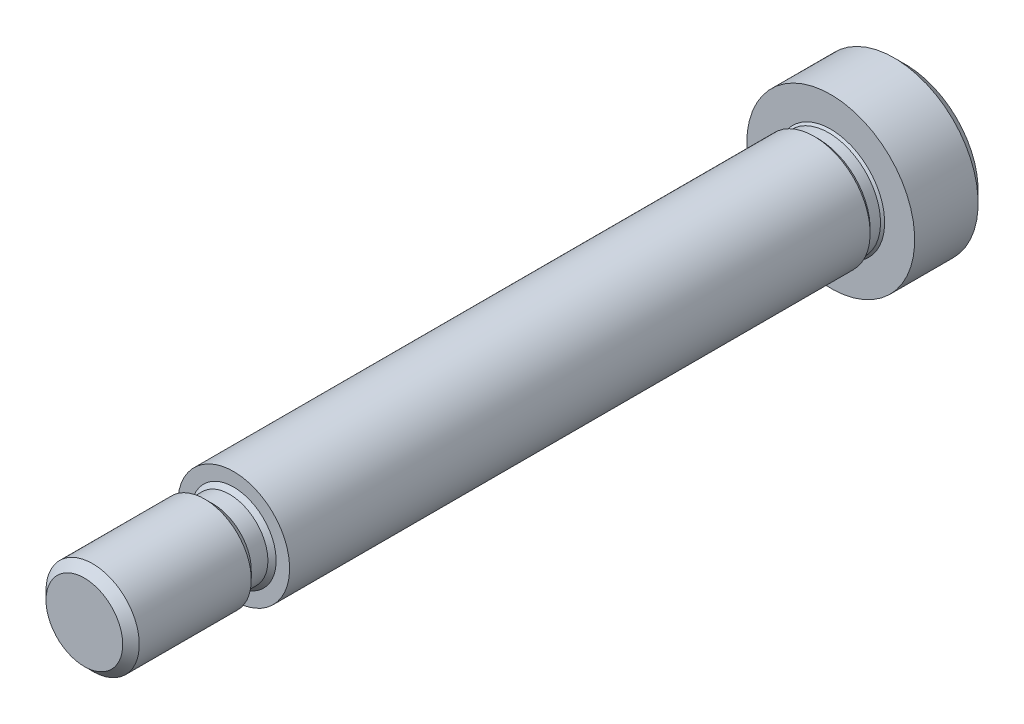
ISO-10303-21;
HEADER;
FILE_DESCRIPTION(('STEP AP214'),'2;1');
FILE_NAME('part.step','',(''),(''),'','','');
FILE_SCHEMA(('AUTOMOTIVE_DESIGN { 1 0 10303 214 1 1 1 1 }'));
ENDSEC;
DATA;
#1=APPLICATION_CONTEXT('core data for automotive mechanical design processes');
#2=APPLICATION_PROTOCOL_DEFINITION('international standard','automotive_design',2000,#1);
#3=PRODUCT_CONTEXT('',#1,'mechanical');
#4=PRODUCT('Part','Part','',(#3));
#5=PRODUCT_RELATED_PRODUCT_CATEGORY('part','',(#4));
#6=PRODUCT_DEFINITION_FORMATION('','',#4);
#7=PRODUCT_DEFINITION_CONTEXT('part definition',#1,'design');
#8=PRODUCT_DEFINITION('design','',#6,#7);
#9=PRODUCT_DEFINITION_SHAPE('','',#8);
#10=(LENGTH_UNIT() NAMED_UNIT(*) SI_UNIT(.MILLI.,.METRE.));
#11=(NAMED_UNIT(*) PLANE_ANGLE_UNIT() SI_UNIT($,.RADIAN.));
#12=(NAMED_UNIT(*) SI_UNIT($,.STERADIAN.) SOLID_ANGLE_UNIT());
#13=UNCERTAINTY_MEASURE_WITH_UNIT(LENGTH_MEASURE(1.E-05),#10,'distance_accuracy_value','');
#14=(GEOMETRIC_REPRESENTATION_CONTEXT(3) GLOBAL_UNCERTAINTY_ASSIGNED_CONTEXT((#13)) GLOBAL_UNIT_ASSIGNED_CONTEXT((#10,
#11,#12)) REPRESENTATION_CONTEXT('',''));
#15=CARTESIAN_POINT('',(0.,0.,0.));
#16=DIRECTION('',(0.,0.,1.));
#17=DIRECTION('',(1.,0.,0.));
#18=AXIS2_PLACEMENT_3D('',#15,#16,#17);
#19=CARTESIAN_POINT('',(0.,0.,-62.352722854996));
#20=DIRECTION('',(0.,0.,-1.));
#21=DIRECTION('',(-1.,0.,0.));
#22=AXIS2_PLACEMENT_3D('',#19,#20,#21);
#23=CYLINDRICAL_SURFACE('',#22,4.7625);
#24=CARTESIAN_POINT('',(0.,0.,-49.3903));
#25=DIRECTION('',(0.,0.,-1.));
#26=DIRECTION('',(-1.,0.,0.));
#27=AXIS2_PLACEMENT_3D('',#24,#25,#26);
#28=CIRCLE('',#27,4.76250000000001);
#29=CARTESIAN_POINT('',(-4.76250000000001,0.,-49.3903));
#30=VERTEX_POINT('',#29);
#31=EDGE_CURVE('E164',#30,#30,#28,.T.);
#32=ORIENTED_EDGE('',*,*,#31,.F.);
#33=EDGE_LOOP('',(#32));
#34=FACE_BOUND('',#33,.T.);
#35=CARTESIAN_POINT('',(0.,0.,0.));
#36=DIRECTION('',(0.,0.,-1.));
#37=DIRECTION('',(-1.,0.,0.));
#38=AXIS2_PLACEMENT_3D('',#35,#36,#37);
#39=CIRCLE('',#38,4.7625);
#40=CARTESIAN_POINT('',(-4.76250000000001,0.,0.));
#41=VERTEX_POINT('',#40);
#42=EDGE_CURVE('E11',#41,#41,#39,.T.);
#43=ORIENTED_EDGE('',*,*,#42,.T.);
#44=EDGE_LOOP('',(#43));
#45=FACE_BOUND('',#44,.T.);
#46=ADVANCED_FACE('F49',(#34,#45),#23,.T.);
#47=CARTESIAN_POINT('',(-4.76250000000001,0.,0.));
#48=DIRECTION('',(0.,0.,-1.));
#49=DIRECTION('',(-1.,0.,0.));
#50=AXIS2_PLACEMENT_3D('',#47,#48,#49);
#51=PLANE('',#50);
#52=ORIENTED_EDGE('',*,*,#42,.F.);
#53=EDGE_LOOP('',(#52));
#54=FACE_BOUND('',#53,.T.);
#55=CARTESIAN_POINT('',(0.,0.,0.));
#56=DIRECTION('',(0.,0.,-1.));
#57=DIRECTION('',(-1.,0.,0.));
#58=AXIS2_PLACEMENT_3D('',#55,#56,#57);
#59=CIRCLE('',#58,3.616325);
#60=CARTESIAN_POINT('',(-3.61632500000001,0.,0.));
#61=VERTEX_POINT('',#60);
#62=EDGE_CURVE('E57',#61,#61,#59,.T.);
#63=ORIENTED_EDGE('',*,*,#62,.T.);
#64=EDGE_LOOP('',(#63));
#65=FACE_BOUND('',#64,.T.);
#66=ADVANCED_FACE('F225',(#54,#65),#51,.F.);
#67=CARTESIAN_POINT('',(0.,0.,0.352425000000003));
#68=DIRECTION('',(0.,0.,-1.));
#69=DIRECTION('',(-1.,0.,0.));
#70=AXIS2_PLACEMENT_3D('',#67,#68,#69);
#71=CONICAL_SURFACE('',#70,3.2639,0.785398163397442);
#72=ORIENTED_EDGE('',*,*,#62,.F.);
#73=EDGE_LOOP('',(#72));
#74=FACE_BOUND('',#73,.T.);
#75=CARTESIAN_POINT('',(0.,0.,0.352425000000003));
#76=DIRECTION('',(0.,0.,-1.));
#77=DIRECTION('',(-1.,0.,0.));
#78=AXIS2_PLACEMENT_3D('',#75,#76,#77);
#79=CIRCLE('',#78,3.2639);
#80=CARTESIAN_POINT('',(-3.26390000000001,0.,0.352425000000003));
#81=VERTEX_POINT('',#80);
#82=EDGE_CURVE('E217',#81,#81,#79,.T.);
#83=ORIENTED_EDGE('',*,*,#82,.T.);
#84=EDGE_LOOP('',(#83));
#85=FACE_BOUND('',#84,.T.);
#86=ADVANCED_FACE('F227',(#74,#85),#71,.T.);
#87=CARTESIAN_POINT('',(0.,0.,-62.352722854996));
#88=DIRECTION('',(0.,0.,-1.));
#89=DIRECTION('',(-1.,0.,0.));
#90=AXIS2_PLACEMENT_3D('',#87,#88,#89);
#91=CYLINDRICAL_SURFACE('',#90,3.2639);
#92=ORIENTED_EDGE('',*,*,#82,.F.);
#93=EDGE_LOOP('',(#92));
#94=FACE_BOUND('',#93,.T.);
#95=CARTESIAN_POINT('',(0.,0.,1.762125));
#96=DIRECTION('',(0.,0.,-1.));
#97=DIRECTION('',(-1.,0.,0.));
#98=AXIS2_PLACEMENT_3D('',#95,#96,#97);
#99=CIRCLE('',#98,3.2639);
#100=CARTESIAN_POINT('',(-3.26390000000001,0.,1.762125));
#101=VERTEX_POINT('',#100);
#102=EDGE_CURVE('E213',#101,#101,#99,.T.);
#103=ORIENTED_EDGE('',*,*,#102,.T.);
#104=EDGE_LOOP('',(#103));
#105=FACE_BOUND('',#104,.T.);
#106=ADVANCED_FACE('F230',(#94,#105),#91,.T.);
#107=CARTESIAN_POINT('',(0.,0.,2.466975));
#108=DIRECTION('',(0.,0.,1.));
#109=DIRECTION('',(1.,0.,0.));
#110=AXIS2_PLACEMENT_3D('',#107,#108,#109);
#111=CONICAL_SURFACE('',#110,3.96875,0.785398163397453);
#112=ORIENTED_EDGE('',*,*,#102,.F.);
#113=EDGE_LOOP('',(#112));
#114=FACE_BOUND('',#113,.T.);
#115=CARTESIAN_POINT('',(0.,0.,2.466975));
#116=DIRECTION('',(0.,0.,-1.));
#117=DIRECTION('',(-1.,0.,0.));
#118=AXIS2_PLACEMENT_3D('',#115,#116,#117);
#119=CIRCLE('',#118,3.96875);
#120=CARTESIAN_POINT('',(-3.96875000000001,0.,2.466975));
#121=VERTEX_POINT('',#120);
#122=EDGE_CURVE('E209',#121,#121,#119,.T.);
#123=ORIENTED_EDGE('',*,*,#122,.T.);
#124=EDGE_LOOP('',(#123));
#125=FACE_BOUND('',#124,.T.);
#126=ADVANCED_FACE('F236',(#114,#125),#111,.T.);
#127=CARTESIAN_POINT('',(0.,0.,-62.352722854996));
#128=DIRECTION('',(0.,0.,-1.));
#129=DIRECTION('',(-1.,0.,0.));
#130=AXIS2_PLACEMENT_3D('',#127,#128,#129);
#131=CYLINDRICAL_SURFACE('',#130,3.96875);
#132=ORIENTED_EDGE('',*,*,#122,.F.);
#133=EDGE_LOOP('',(#132));
#134=FACE_BOUND('',#133,.T.);
#135=CARTESIAN_POINT('',(0.,0.,11.99515));
#136=DIRECTION('',(0.,0.,-1.));
#137=DIRECTION('',(-1.,0.,0.));
#138=AXIS2_PLACEMENT_3D('',#135,#136,#137);
#139=CIRCLE('',#138,3.96875);
#140=CARTESIAN_POINT('',(-3.96875000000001,0.,11.99515));
#141=VERTEX_POINT('',#140);
#142=EDGE_CURVE('E205',#141,#141,#139,.T.);
#143=ORIENTED_EDGE('',*,*,#142,.T.);
#144=EDGE_LOOP('',(#143));
#145=FACE_BOUND('',#144,.T.);
#146=ADVANCED_FACE('F242',(#134,#145),#131,.T.);
#147=CARTESIAN_POINT('',(0.,0.,12.7));
#148=DIRECTION('',(0.,0.,-1.));
#149=DIRECTION('',(-1.,0.,0.));
#150=AXIS2_PLACEMENT_3D('',#147,#148,#149);
#151=CONICAL_SURFACE('',#150,3.2639,0.785398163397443);
#152=ORIENTED_EDGE('',*,*,#142,.F.);
#153=EDGE_LOOP('',(#152));
#154=FACE_BOUND('',#153,.T.);
#155=CARTESIAN_POINT('',(0.,0.,12.7));
#156=DIRECTION('',(0.,0.,-1.));
#157=DIRECTION('',(-1.,0.,0.));
#158=AXIS2_PLACEMENT_3D('',#155,#156,#157);
#159=CIRCLE('',#158,3.2639);
#160=CARTESIAN_POINT('',(-3.26390000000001,0.,12.7));
#161=VERTEX_POINT('',#160);
#162=EDGE_CURVE('E201',#161,#161,#159,.T.);
#163=ORIENTED_EDGE('',*,*,#162,.T.);
#164=EDGE_LOOP('',(#163));
#165=FACE_BOUND('',#164,.T.);
#166=ADVANCED_FACE('F248',(#154,#165),#151,.T.);
#167=CARTESIAN_POINT('',(-3.26390000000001,0.,12.7));
#168=DIRECTION('',(0.,0.,-1.));
#169=DIRECTION('',(-1.,0.,0.));
#170=AXIS2_PLACEMENT_3D('',#167,#168,#169);
#171=PLANE('',#170);
#172=ORIENTED_EDGE('',*,*,#162,.F.);
#173=EDGE_LOOP('',(#172));
#174=FACE_BOUND('',#173,.T.);
#175=ADVANCED_FACE('F254',(#174),#171,.F.);
#176=CARTESIAN_POINT('',(-6.19125,0.,-57.15));
#177=DIRECTION('',(0.,0.,1.));
#178=DIRECTION('',(1.,0.,0.));
#179=AXIS2_PLACEMENT_3D('',#176,#177,#178);
#180=PLANE('',#179);
#181=DIRECTION('',(-0.5,-0.866025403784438,0.));
#182=VECTOR('',#181,1.);
#183=CARTESIAN_POINT('',(2.7496306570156,0.,-57.15));
#184=LINE('',#183,#182);
#185=CARTESIAN_POINT('',(2.7496306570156,0.,-57.15));
#186=VERTEX_POINT('',#185);
#187=CARTESIAN_POINT('',(1.3748153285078,-2.38125000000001,-57.15));
#188=VERTEX_POINT('',#187);
#189=EDGE_CURVE('E145',#186,#188,#184,.T.);
#190=ORIENTED_EDGE('',*,*,#189,.F.);
#191=DIRECTION('',(0.499999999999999,-0.866025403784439,0.));
#192=VECTOR('',#191,1.);
#193=CARTESIAN_POINT('',(1.3748153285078,2.38124999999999,-57.15));
#194=LINE('',#193,#192);
#195=CARTESIAN_POINT('',(1.3748153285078,2.38124999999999,-57.15));
#196=VERTEX_POINT('',#195);
#197=EDGE_CURVE('E64',#196,#186,#194,.T.);
#198=ORIENTED_EDGE('',*,*,#197,.F.);
#199=DIRECTION('',(1.,0.,0.));
#200=VECTOR('',#199,1.);
#201=CARTESIAN_POINT('',(-1.37481532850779,2.38124999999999,-57.15));
#202=LINE('',#201,#200);
#203=CARTESIAN_POINT('',(-1.37481532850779,2.38124999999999,-57.15));
#204=VERTEX_POINT('',#203);
#205=EDGE_CURVE('E158',#204,#196,#202,.T.);
#206=ORIENTED_EDGE('',*,*,#205,.F.);
#207=DIRECTION('',(0.5,0.866025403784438,0.));
#208=VECTOR('',#207,1.);
#209=CARTESIAN_POINT('',(-2.74963065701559,0.,-57.15));
#210=LINE('',#209,#208);
#211=CARTESIAN_POINT('',(-2.74963065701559,0.,-57.15));
#212=VERTEX_POINT('',#211);
#213=EDGE_CURVE('E155',#212,#204,#210,.T.);
#214=ORIENTED_EDGE('',*,*,#213,.F.);
#215=DIRECTION('',(-0.5,0.866025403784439,0.));
#216=VECTOR('',#215,1.);
#217=CARTESIAN_POINT('',(-1.37481532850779,-2.38125000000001,-57.15));
#218=LINE('',#217,#216);
#219=CARTESIAN_POINT('',(-1.37481532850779,-2.38125000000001,-57.15));
#220=VERTEX_POINT('',#219);
#221=EDGE_CURVE('E112',#220,#212,#218,.T.);
#222=ORIENTED_EDGE('',*,*,#221,.F.);
#223=DIRECTION('',(-1.,0.,0.));
#224=VECTOR('',#223,1.);
#225=CARTESIAN_POINT('',(1.3748153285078,-2.38125000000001,-57.15));
#226=LINE('',#225,#224);
#227=EDGE_CURVE('E149',#188,#220,#226,.T.);
#228=ORIENTED_EDGE('',*,*,#227,.F.);
#229=EDGE_LOOP('',(#190,#198,#206,#214,#222,#228));
#230=FACE_BOUND('',#229,.T.);
#231=CARTESIAN_POINT('',(0.,0.,-57.15));
#232=DIRECTION('',(0.,0.,-1.));
#233=DIRECTION('',(-1.,0.,0.));
#234=AXIS2_PLACEMENT_3D('',#231,#232,#233);
#235=CIRCLE('',#234,6.19125);
#236=CARTESIAN_POINT('',(-6.19125,0.,-57.15));
#237=VERTEX_POINT('',#236);
#238=EDGE_CURVE('E197',#237,#237,#235,.T.);
#239=ORIENTED_EDGE('',*,*,#238,.T.);
#240=EDGE_LOOP('',(#239));
#241=FACE_BOUND('',#240,.T.);
#242=ADVANCED_FACE('F259',(#230,#241),#180,.F.);
#243=CARTESIAN_POINT('',(0.,0.,-56.1975));
#244=DIRECTION('',(0.,0.,1.));
#245=DIRECTION('',(1.,0.,0.));
#246=AXIS2_PLACEMENT_3D('',#243,#244,#245);
#247=CONICAL_SURFACE('',#246,7.14375,0.78539816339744);
#248=ORIENTED_EDGE('',*,*,#238,.F.);
#249=EDGE_LOOP('',(#248));
#250=FACE_BOUND('',#249,.T.);
#251=CARTESIAN_POINT('',(0.,0.,-56.1975));
#252=DIRECTION('',(0.,0.,-1.));
#253=DIRECTION('',(-1.,0.,0.));
#254=AXIS2_PLACEMENT_3D('',#251,#252,#253);
#255=CIRCLE('',#254,7.14375);
#256=CARTESIAN_POINT('',(-7.14375,0.,-56.1975));
#257=VERTEX_POINT('',#256);
#258=EDGE_CURVE('E193',#257,#257,#255,.T.);
#259=ORIENTED_EDGE('',*,*,#258,.T.);
#260=EDGE_LOOP('',(#259));
#261=FACE_BOUND('',#260,.T.);
#262=ADVANCED_FACE('F266',(#250,#261),#247,.T.);
#263=CARTESIAN_POINT('',(0.,0.,-62.352722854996));
#264=DIRECTION('',(0.,0.,-1.));
#265=DIRECTION('',(-1.,0.,0.));
#266=AXIS2_PLACEMENT_3D('',#263,#264,#265);
#267=CYLINDRICAL_SURFACE('',#266,7.14375);
#268=ORIENTED_EDGE('',*,*,#258,.F.);
#269=EDGE_LOOP('',(#268));
#270=FACE_BOUND('',#269,.T.);
#271=CARTESIAN_POINT('',(0.,0.,-50.8));
#272=DIRECTION('',(0.,0.,-1.));
#273=DIRECTION('',(-1.,0.,0.));
#274=AXIS2_PLACEMENT_3D('',#271,#272,#273);
#275=CIRCLE('',#274,7.14375);
#276=CARTESIAN_POINT('',(-7.14375,0.,-50.8));
#277=VERTEX_POINT('',#276);
#278=EDGE_CURVE('E189',#277,#277,#275,.T.);
#279=ORIENTED_EDGE('',*,*,#278,.T.);
#280=EDGE_LOOP('',(#279));
#281=FACE_BOUND('',#280,.T.);
#282=ADVANCED_FACE('F303',(#270,#281),#267,.T.);
#283=CARTESIAN_POINT('',(-4.58628750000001,0.,-50.8));
#284=DIRECTION('',(0.,0.,-1.));
#285=DIRECTION('',(-1.,0.,0.));
#286=AXIS2_PLACEMENT_3D('',#283,#284,#285);
#287=PLANE('',#286);
#288=ORIENTED_EDGE('',*,*,#278,.F.);
#289=EDGE_LOOP('',(#288));
#290=FACE_BOUND('',#289,.T.);
#291=CARTESIAN_POINT('',(0.,0.,-50.8));
#292=DIRECTION('',(0.,0.,-1.));
#293=DIRECTION('',(-1.,0.,0.));
#294=AXIS2_PLACEMENT_3D('',#291,#292,#293);
#295=CIRCLE('',#294,4.58628750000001);
#296=CARTESIAN_POINT('',(-4.58628750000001,0.,-50.8));
#297=VERTEX_POINT('',#296);
#298=EDGE_CURVE('E185',#297,#297,#295,.T.);
#299=ORIENTED_EDGE('',*,*,#298,.T.);
#300=EDGE_LOOP('',(#299));
#301=FACE_BOUND('',#300,.T.);
#302=ADVANCED_FACE('F299',(#290,#301),#287,.F.);
#303=CARTESIAN_POINT('',(0.,0.,-50.6237875));
#304=DIRECTION('',(0.,0.,-1.));
#305=DIRECTION('',(-1.,0.,0.));
#306=AXIS2_PLACEMENT_3D('',#303,#304,#305);
#307=CONICAL_SURFACE('',#306,4.41007500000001,0.785398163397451);
#308=ORIENTED_EDGE('',*,*,#298,.F.);
#309=EDGE_LOOP('',(#308));
#310=FACE_BOUND('',#309,.T.);
#311=CARTESIAN_POINT('',(0.,0.,-50.6237875));
#312=DIRECTION('',(0.,0.,-1.));
#313=DIRECTION('',(-1.,0.,0.));
#314=AXIS2_PLACEMENT_3D('',#311,#312,#313);
#315=CIRCLE('',#314,4.41007500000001);
#316=CARTESIAN_POINT('',(-4.41007500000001,0.,-50.6237875));
#317=VERTEX_POINT('',#316);
#318=EDGE_CURVE('E181',#317,#317,#315,.T.);
#319=ORIENTED_EDGE('',*,*,#318,.T.);
#320=EDGE_LOOP('',(#319));
#321=FACE_BOUND('',#320,.T.);
#322=ADVANCED_FACE('F291',(#310,#321),#307,.T.);
#323=CARTESIAN_POINT('',(0.,0.,-62.352722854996));
#324=DIRECTION('',(0.,0.,-1.));
#325=DIRECTION('',(-1.,0.,0.));
#326=AXIS2_PLACEMENT_3D('',#323,#324,#325);
#327=CYLINDRICAL_SURFACE('',#326,4.410075);
#328=ORIENTED_EDGE('',*,*,#318,.F.);
#329=EDGE_LOOP('',(#328));
#330=FACE_BOUND('',#329,.T.);
#331=CARTESIAN_POINT('',(0.,0.,-49.742725));
#332=DIRECTION('',(0.,0.,-1.));
#333=DIRECTION('',(-1.,0.,0.));
#334=AXIS2_PLACEMENT_3D('',#331,#332,#333);
#335=CIRCLE('',#334,4.410075);
#336=CARTESIAN_POINT('',(-4.41007500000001,0.,-49.742725));
#337=VERTEX_POINT('',#336);
#338=EDGE_CURVE('E177',#337,#337,#335,.T.);
#339=ORIENTED_EDGE('',*,*,#338,.T.);
#340=EDGE_LOOP('',(#339));
#341=FACE_BOUND('',#340,.T.);
#342=ADVANCED_FACE('F282',(#330,#341),#327,.T.);
#343=CARTESIAN_POINT('',(0.,0.,-49.3903));
#344=DIRECTION('',(0.,0.,1.));
#345=DIRECTION('',(1.,0.,0.));
#346=AXIS2_PLACEMENT_3D('',#343,#344,#345);
#347=CONICAL_SURFACE('',#346,4.76250000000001,0.785398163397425);
#348=ORIENTED_EDGE('',*,*,#338,.F.);
#349=EDGE_LOOP('',(#348));
#350=FACE_BOUND('',#349,.T.);
#351=ORIENTED_EDGE('',*,*,#31,.T.);
#352=EDGE_LOOP('',(#351));
#353=FACE_BOUND('',#352,.T.);
#354=ADVANCED_FACE('F279',(#350,#353),#347,.T.);
#355=CARTESIAN_POINT('',(1.3748153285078,2.38124999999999,-52.9166666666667));
#356=DIRECTION('',(0.866025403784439,0.499999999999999,0.));
#357=DIRECTION('',(-0.499999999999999,0.866025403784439,0.));
#358=AXIS2_PLACEMENT_3D('',#355,#356,#357);
#359=PLANE('',#358);
#360=ORIENTED_EDGE('',*,*,#197,.T.);
#361=DIRECTION('',(0.,0.,-1.));
#362=VECTOR('',#361,1.);
#363=CARTESIAN_POINT('',(2.7496306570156,0.,-52.9166666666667));
#364=LINE('',#363,#362);
#365=CARTESIAN_POINT('',(2.7496306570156,0.,-52.9166666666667));
#366=VERTEX_POINT('',#365);
#367=EDGE_CURVE('E94',#366,#186,#364,.T.);
#368=ORIENTED_EDGE('',*,*,#367,.F.);
#369=DIRECTION('',(0.499999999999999,-0.866025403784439,0.));
#370=VECTOR('',#369,1.);
#371=CARTESIAN_POINT('',(1.3748153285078,2.38124999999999,-52.9166666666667));
#372=LINE('',#371,#370);
#373=CARTESIAN_POINT('',(1.3748153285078,2.38124999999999,-52.9166666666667));
#374=VERTEX_POINT('',#373);
#375=EDGE_CURVE('E161',#374,#366,#372,.T.);
#376=ORIENTED_EDGE('',*,*,#375,.F.);
#377=DIRECTION('',(0.,0.,-1.));
#378=VECTOR('',#377,1.);
#379=CARTESIAN_POINT('',(1.3748153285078,2.38124999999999,-52.9166666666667));
#380=LINE('',#379,#378);
#381=EDGE_CURVE('E72',#374,#196,#380,.T.);
#382=ORIENTED_EDGE('',*,*,#381,.T.);
#383=EDGE_LOOP('',(#360,#368,#376,#382));
#384=FACE_BOUND('',#383,.T.);
#385=ADVANCED_FACE('F281',(#384),#359,.F.);
#386=CARTESIAN_POINT('',(-1.37481532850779,2.38125,-52.9166666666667));
#387=DIRECTION('',(0.,1.,0.));
#388=DIRECTION('',(-1.,0.,0.));
#389=AXIS2_PLACEMENT_3D('',#386,#387,#388);
#390=PLANE('',#389);
#391=ORIENTED_EDGE('',*,*,#205,.T.);
#392=ORIENTED_EDGE('',*,*,#381,.F.);
#393=DIRECTION('',(1.,0.,0.));
#394=VECTOR('',#393,1.);
#395=CARTESIAN_POINT('',(-1.37481532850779,2.38125,-52.9166666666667));
#396=LINE('',#395,#394);
#397=CARTESIAN_POINT('',(-1.37481532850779,2.38125,-52.9166666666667));
#398=VERTEX_POINT('',#397);
#399=EDGE_CURVE('E126',#398,#374,#396,.T.);
#400=ORIENTED_EDGE('',*,*,#399,.F.);
#401=DIRECTION('',(0.,0.,-1.));
#402=VECTOR('',#401,1.);
#403=CARTESIAN_POINT('',(-1.37481532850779,2.38125,-52.9166666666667));
#404=LINE('',#403,#402);
#405=EDGE_CURVE('E117',#398,#204,#404,.T.);
#406=ORIENTED_EDGE('',*,*,#405,.T.);
#407=EDGE_LOOP('',(#391,#392,#400,#406));
#408=FACE_BOUND('',#407,.T.);
#409=ADVANCED_FACE('F289',(#408),#390,.F.);
#410=CARTESIAN_POINT('',(-2.74963065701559,0.,-52.9166666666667));
#411=DIRECTION('',(-0.866025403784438,0.5,0.));
#412=DIRECTION('',(-0.5,-0.866025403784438,0.));
#413=AXIS2_PLACEMENT_3D('',#410,#411,#412);
#414=PLANE('',#413);
#415=ORIENTED_EDGE('',*,*,#213,.T.);
#416=ORIENTED_EDGE('',*,*,#405,.F.);
#417=DIRECTION('',(0.5,0.866025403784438,0.));
#418=VECTOR('',#417,1.);
#419=CARTESIAN_POINT('',(-2.74963065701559,0.,-52.9166666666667));
#420=LINE('',#419,#418);
#421=CARTESIAN_POINT('',(-2.74963065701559,0.,-52.9166666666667));
#422=VERTEX_POINT('',#421);
#423=EDGE_CURVE('E121',#422,#398,#420,.T.);
#424=ORIENTED_EDGE('',*,*,#423,.F.);
#425=DIRECTION('',(0.,0.,-1.));
#426=VECTOR('',#425,1.);
#427=CARTESIAN_POINT('',(-2.74963065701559,0.,-52.9166666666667));
#428=LINE('',#427,#426);
#429=EDGE_CURVE('E105',#422,#212,#428,.T.);
#430=ORIENTED_EDGE('',*,*,#429,.T.);
#431=EDGE_LOOP('',(#415,#416,#424,#430));
#432=FACE_BOUND('',#431,.T.);
#433=ADVANCED_FACE('F122',(#432),#414,.F.);
#434=CARTESIAN_POINT('',(-1.37481532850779,-2.38125,-52.9166666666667));
#435=DIRECTION('',(-0.866025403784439,-0.5,0.));
#436=DIRECTION('',(0.5,-0.866025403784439,0.));
#437=AXIS2_PLACEMENT_3D('',#434,#435,#436);
#438=PLANE('',#437);
#439=ORIENTED_EDGE('',*,*,#221,.T.);
#440=ORIENTED_EDGE('',*,*,#429,.F.);
#441=DIRECTION('',(-0.5,0.866025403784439,0.));
#442=VECTOR('',#441,1.);
#443=CARTESIAN_POINT('',(-1.37481532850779,-2.38125,-52.9166666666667));
#444=LINE('',#443,#442);
#445=CARTESIAN_POINT('',(-1.37481532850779,-2.38125,-52.9166666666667));
#446=VERTEX_POINT('',#445);
#447=EDGE_CURVE('E109',#446,#422,#444,.T.);
#448=ORIENTED_EDGE('',*,*,#447,.F.);
#449=DIRECTION('',(0.,0.,-1.));
#450=VECTOR('',#449,1.);
#451=CARTESIAN_POINT('',(-1.37481532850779,-2.38125,-52.9166666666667));
#452=LINE('',#451,#450);
#453=EDGE_CURVE('E118',#446,#220,#452,.T.);
#454=ORIENTED_EDGE('',*,*,#453,.T.);
#455=EDGE_LOOP('',(#439,#440,#448,#454));
#456=FACE_BOUND('',#455,.T.);
#457=ADVANCED_FACE('F107',(#456),#438,.F.);
#458=CARTESIAN_POINT('',(1.3748153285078,-2.38125000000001,-52.9166666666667));
#459=DIRECTION('',(0.,-1.,0.));
#460=DIRECTION('',(1.,0.,0.));
#461=AXIS2_PLACEMENT_3D('',#458,#459,#460);
#462=PLANE('',#461);
#463=ORIENTED_EDGE('',*,*,#227,.T.);
#464=ORIENTED_EDGE('',*,*,#453,.F.);
#465=DIRECTION('',(-1.,0.,0.));
#466=VECTOR('',#465,1.);
#467=CARTESIAN_POINT('',(1.3748153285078,-2.38125000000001,-52.9166666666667));
#468=LINE('',#467,#466);
#469=CARTESIAN_POINT('',(1.3748153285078,-2.38125000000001,-52.9166666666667));
#470=VERTEX_POINT('',#469);
#471=EDGE_CURVE('E132',#470,#446,#468,.T.);
#472=ORIENTED_EDGE('',*,*,#471,.F.);
#473=DIRECTION('',(0.,0.,-1.));
#474=VECTOR('',#473,1.);
#475=CARTESIAN_POINT('',(1.3748153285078,-2.38125000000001,-52.9166666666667));
#476=LINE('',#475,#474);
#477=EDGE_CURVE('E169',#470,#188,#476,.T.);
#478=ORIENTED_EDGE('',*,*,#477,.T.);
#479=EDGE_LOOP('',(#463,#464,#472,#478));
#480=FACE_BOUND('',#479,.T.);
#481=ADVANCED_FACE('F386',(#480),#462,.F.);
#482=CARTESIAN_POINT('',(2.7496306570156,0.,-52.9166666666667));
#483=DIRECTION('',(0.866025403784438,-0.5,0.));
#484=DIRECTION('',(0.5,0.866025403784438,0.));
#485=AXIS2_PLACEMENT_3D('',#482,#483,#484);
#486=PLANE('',#485);
#487=ORIENTED_EDGE('',*,*,#189,.T.);
#488=ORIENTED_EDGE('',*,*,#477,.F.);
#489=DIRECTION('',(-0.5,-0.866025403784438,0.));
#490=VECTOR('',#489,1.);
#491=CARTESIAN_POINT('',(2.7496306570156,0.,-52.9166666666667));
#492=LINE('',#491,#490);
#493=EDGE_CURVE('E137',#366,#470,#492,.T.);
#494=ORIENTED_EDGE('',*,*,#493,.F.);
#495=ORIENTED_EDGE('',*,*,#367,.T.);
#496=EDGE_LOOP('',(#487,#488,#494,#495));
#497=FACE_BOUND('',#496,.T.);
#498=ADVANCED_FACE('F397',(#497),#486,.F.);
#499=CARTESIAN_POINT('',(1.3748153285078,2.38124999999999,-52.9166666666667));
#500=DIRECTION('',(0.,0.,1.));
#501=DIRECTION('',(1.,0.,0.));
#502=AXIS2_PLACEMENT_3D('',#499,#500,#501);
#503=PLANE('',#502);
#504=ORIENTED_EDGE('',*,*,#375,.T.);
#505=ORIENTED_EDGE('',*,*,#493,.T.);
#506=ORIENTED_EDGE('',*,*,#471,.T.);
#507=ORIENTED_EDGE('',*,*,#447,.T.);
#508=ORIENTED_EDGE('',*,*,#423,.T.);
#509=ORIENTED_EDGE('',*,*,#399,.T.);
#510=EDGE_LOOP('',(#504,#505,#506,#507,#508,#509));
#511=FACE_BOUND('',#510,.T.);
#512=ADVANCED_FACE('F129',(#511),#503,.F.);
#513=CLOSED_SHELL('',(#46,#66,#86,#106,#126,#146,#166,#175,#242,#262,#282,#302,#322,#342,#354,
#385,#409,#433,#457,#481,#498,#512));
#514=MANIFOLD_SOLID_BREP('B2',#513);
#515=ADVANCED_BREP_SHAPE_REPRESENTATION('',(#18,#514),#14);
#516=SHAPE_DEFINITION_REPRESENTATION(#9,#515);
ENDSEC;
END-ISO-10303-21;
